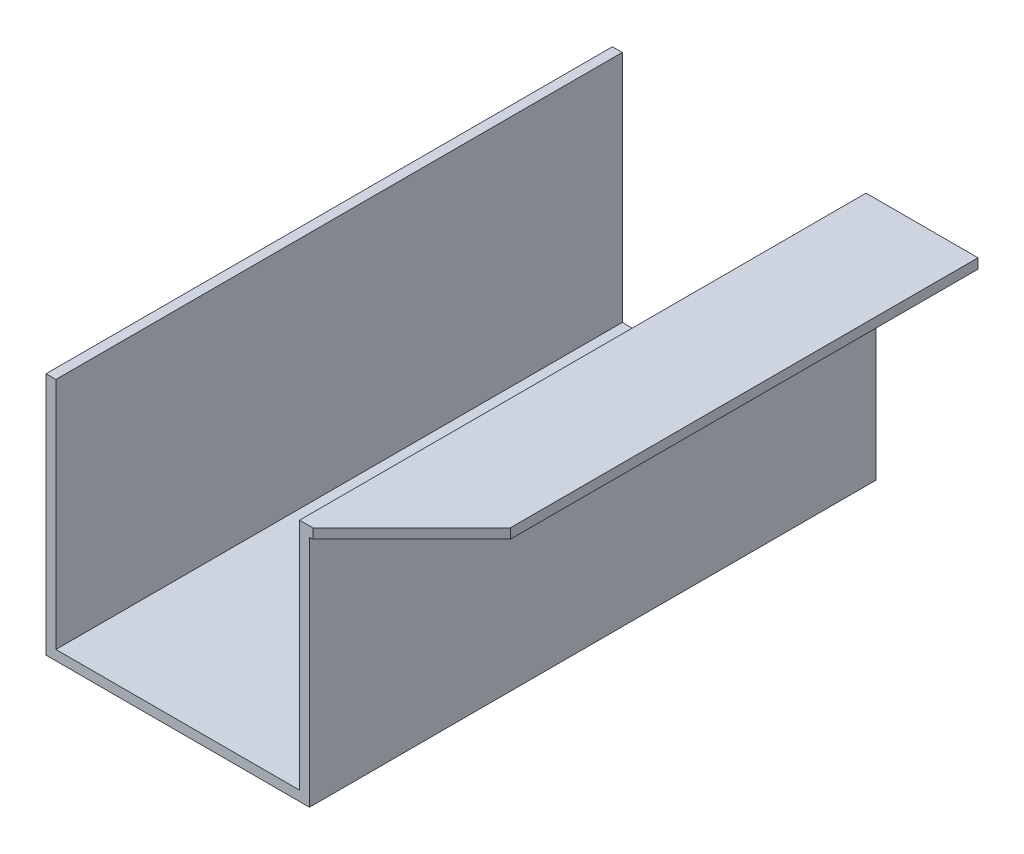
ISO-10303-21;
HEADER;
FILE_DESCRIPTION(('STEP AP214'),'2;1');
FILE_NAME('part.step','',(''),(''),'','','');
FILE_SCHEMA(('AUTOMOTIVE_DESIGN { 1 0 10303 214 1 1 1 1 }'));
ENDSEC;
DATA;
#1=APPLICATION_CONTEXT('core data for automotive mechanical design processes');
#2=APPLICATION_PROTOCOL_DEFINITION('international standard','automotive_design',2000,#1);
#3=PRODUCT_CONTEXT('',#1,'mechanical');
#4=PRODUCT('Part','Part','',(#3));
#5=PRODUCT_RELATED_PRODUCT_CATEGORY('part','',(#4));
#6=PRODUCT_DEFINITION_FORMATION('','',#4);
#7=PRODUCT_DEFINITION_CONTEXT('part definition',#1,'design');
#8=PRODUCT_DEFINITION('design','',#6,#7);
#9=PRODUCT_DEFINITION_SHAPE('','',#8);
#10=(LENGTH_UNIT() NAMED_UNIT(*) SI_UNIT(.MILLI.,.METRE.));
#11=(NAMED_UNIT(*) PLANE_ANGLE_UNIT() SI_UNIT($,.RADIAN.));
#12=(NAMED_UNIT(*) SI_UNIT($,.STERADIAN.) SOLID_ANGLE_UNIT());
#13=UNCERTAINTY_MEASURE_WITH_UNIT(LENGTH_MEASURE(1.E-05),#10,'distance_accuracy_value','');
#14=(GEOMETRIC_REPRESENTATION_CONTEXT(3) GLOBAL_UNCERTAINTY_ASSIGNED_CONTEXT((#13)) GLOBAL_UNIT_ASSIGNED_CONTEXT((#10,
#11,#12)) REPRESENTATION_CONTEXT('',''));
#15=CARTESIAN_POINT('',(0.,0.,0.));
#16=DIRECTION('',(0.,0.,1.));
#17=DIRECTION('',(1.,0.,0.));
#18=AXIS2_PLACEMENT_3D('',#15,#16,#17);
#19=CARTESIAN_POINT('',(-1.5,0.,86.));
#20=DIRECTION('',(0.,-1.,0.));
#21=DIRECTION('',(0.,0.,-1.));
#22=AXIS2_PLACEMENT_3D('',#19,#20,#21);
#23=PLANE('',#22);
#24=DIRECTION('',(-1.,0.,0.));
#25=VECTOR('',#24,1.);
#26=CARTESIAN_POINT('',(-1.5,0.,0.));
#27=LINE('',#26,#25);
#28=CARTESIAN_POINT('',(0.,0.,0.));
#29=VERTEX_POINT('',#28);
#30=CARTESIAN_POINT('',(-1.5,0.,0.));
#31=VERTEX_POINT('',#30);
#32=EDGE_CURVE('E115',#29,#31,#27,.T.);
#33=ORIENTED_EDGE('',*,*,#32,.T.);
#34=DIRECTION('',(0.,0.,-1.));
#35=VECTOR('',#34,1.);
#36=CARTESIAN_POINT('',(-1.5,0.,86.));
#37=LINE('',#36,#35);
#38=CARTESIAN_POINT('',(-1.5,0.,86.));
#39=VERTEX_POINT('',#38);
#40=EDGE_CURVE('E123',#39,#31,#37,.T.);
#41=ORIENTED_EDGE('',*,*,#40,.F.);
#42=DIRECTION('',(-1.,0.,0.));
#43=VECTOR('',#42,1.);
#44=CARTESIAN_POINT('',(-1.5,0.,86.));
#45=LINE('',#44,#43);
#46=CARTESIAN_POINT('',(0.,0.,86.));
#47=VERTEX_POINT('',#46);
#48=EDGE_CURVE('E154',#47,#39,#45,.T.);
#49=ORIENTED_EDGE('',*,*,#48,.F.);
#50=DIRECTION('',(0.,0.,-1.));
#51=VECTOR('',#50,1.);
#52=CARTESIAN_POINT('',(0.,0.,86.));
#53=LINE('',#52,#51);
#54=EDGE_CURVE('E134',#47,#29,#53,.T.);
#55=ORIENTED_EDGE('',*,*,#54,.T.);
#56=EDGE_LOOP('',(#33,#41,#49,#55));
#57=FACE_BOUND('',#56,.T.);
#58=ADVANCED_FACE('F30',(#57),#23,.F.);
#59=CARTESIAN_POINT('',(-1.5,0.,86.));
#60=DIRECTION('',(1.,0.,0.));
#61=DIRECTION('',(0.,1.,0.));
#62=AXIS2_PLACEMENT_3D('',#59,#60,#61);
#63=PLANE('',#62);
#64=DIRECTION('',(0.,-1.,0.));
#65=VECTOR('',#64,1.);
#66=CARTESIAN_POINT('',(-1.5,0.,0.));
#67=LINE('',#66,#65);
#68=CARTESIAN_POINT('',(-1.5,-37.,0.));
#69=VERTEX_POINT('',#68);
#70=EDGE_CURVE('E110',#31,#69,#67,.T.);
#71=ORIENTED_EDGE('',*,*,#70,.T.);
#72=DIRECTION('',(0.,0.,-1.));
#73=VECTOR('',#72,1.);
#74=CARTESIAN_POINT('',(-1.5,-37.,86.));
#75=LINE('',#74,#73);
#76=CARTESIAN_POINT('',(-1.5,-37.,86.));
#77=VERTEX_POINT('',#76);
#78=EDGE_CURVE('E130',#77,#69,#75,.T.);
#79=ORIENTED_EDGE('',*,*,#78,.F.);
#80=DIRECTION('',(0.,-1.,0.));
#81=VECTOR('',#80,1.);
#82=CARTESIAN_POINT('',(-1.5,0.,86.));
#83=LINE('',#82,#81);
#84=EDGE_CURVE('E125',#39,#77,#83,.T.);
#85=ORIENTED_EDGE('',*,*,#84,.F.);
#86=ORIENTED_EDGE('',*,*,#40,.T.);
#87=EDGE_LOOP('',(#71,#79,#85,#86));
#88=FACE_BOUND('',#87,.T.);
#89=ADVANCED_FACE('F124',(#88),#63,.F.);
#90=CARTESIAN_POINT('',(-1.5,-37.,86.));
#91=DIRECTION('',(0.,1.,0.));
#92=DIRECTION('',(0.,0.,1.));
#93=AXIS2_PLACEMENT_3D('',#90,#91,#92);
#94=PLANE('',#93);
#95=DIRECTION('',(1.,0.,0.));
#96=VECTOR('',#95,1.);
#97=CARTESIAN_POINT('',(-1.5,-37.,0.));
#98=LINE('',#97,#96);
#99=CARTESIAN_POINT('',(38.5,-37.,0.));
#100=VERTEX_POINT('',#99);
#101=EDGE_CURVE('E117',#69,#100,#98,.T.);
#102=ORIENTED_EDGE('',*,*,#101,.T.);
#103=DIRECTION('',(0.,0.,-1.));
#104=VECTOR('',#103,1.);
#105=CARTESIAN_POINT('',(38.5,-37.,86.));
#106=LINE('',#105,#104);
#107=CARTESIAN_POINT('',(38.5,-37.,86.));
#108=VERTEX_POINT('',#107);
#109=EDGE_CURVE('E189',#108,#100,#106,.T.);
#110=ORIENTED_EDGE('',*,*,#109,.F.);
#111=DIRECTION('',(1.,0.,0.));
#112=VECTOR('',#111,1.);
#113=CARTESIAN_POINT('',(-1.5,-37.,86.));
#114=LINE('',#113,#112);
#115=EDGE_CURVE('E157',#77,#108,#114,.T.);
#116=ORIENTED_EDGE('',*,*,#115,.F.);
#117=ORIENTED_EDGE('',*,*,#78,.T.);
#118=EDGE_LOOP('',(#102,#110,#116,#117));
#119=FACE_BOUND('',#118,.T.);
#120=ADVANCED_FACE('F220',(#119),#94,.F.);
#121=CARTESIAN_POINT('',(38.5,-37.,86.));
#122=DIRECTION('',(-1.,0.,0.));
#123=DIRECTION('',(0.,0.,1.));
#124=AXIS2_PLACEMENT_3D('',#121,#122,#123);
#125=PLANE('',#124);
#126=DIRECTION('',(0.,1.,0.));
#127=VECTOR('',#126,1.);
#128=CARTESIAN_POINT('',(38.5,-37.,0.));
#129=LINE('',#128,#127);
#130=CARTESIAN_POINT('',(38.5,-1.5,0.));
#131=VERTEX_POINT('',#130);
#132=EDGE_CURVE('E138',#100,#131,#129,.T.);
#133=ORIENTED_EDGE('',*,*,#132,.T.);
#134=DIRECTION('',(0.,0.,-1.));
#135=VECTOR('',#134,1.);
#136=CARTESIAN_POINT('',(38.5,-1.5,86.));
#137=LINE('',#136,#135);
#138=CARTESIAN_POINT('',(38.5,-1.5,86.));
#139=VERTEX_POINT('',#138);
#140=EDGE_CURVE('E186',#139,#131,#137,.T.);
#141=ORIENTED_EDGE('',*,*,#140,.F.);
#142=DIRECTION('',(0.,1.,0.));
#143=VECTOR('',#142,1.);
#144=CARTESIAN_POINT('',(38.5,-37.,86.));
#145=LINE('',#144,#143);
#146=EDGE_CURVE('E159',#108,#139,#145,.T.);
#147=ORIENTED_EDGE('',*,*,#146,.F.);
#148=ORIENTED_EDGE('',*,*,#109,.T.);
#149=EDGE_LOOP('',(#133,#141,#147,#148));
#150=FACE_BOUND('',#149,.T.);
#151=ADVANCED_FACE('F224',(#150),#125,.F.);
#152=CARTESIAN_POINT('',(38.5,-1.5,86.));
#153=DIRECTION('',(0.,1.,0.));
#154=DIRECTION('',(-1.,0.,0.));
#155=AXIS2_PLACEMENT_3D('',#152,#153,#154);
#156=PLANE('',#155);
#157=DIRECTION('',(0.,0.,-1.));
#158=VECTOR('',#157,1.);
#159=CARTESIAN_POINT('',(54.,-1.5,86.));
#160=LINE('',#159,#158);
#161=CARTESIAN_POINT('',(54.,-1.5,71.));
#162=VERTEX_POINT('',#161);
#163=CARTESIAN_POINT('',(54.,-1.5,0.));
#164=VERTEX_POINT('',#163);
#165=EDGE_CURVE('E184',#162,#164,#160,.T.);
#166=ORIENTED_EDGE('',*,*,#165,.F.);
#167=DIRECTION('',(-0.707106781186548,0.,0.707106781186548));
#168=VECTOR('',#167,1.);
#169=CARTESIAN_POINT('',(39.,-1.5,86.));
#170=LINE('',#169,#168);
#171=CARTESIAN_POINT('',(39.,-1.5,86.));
#172=VERTEX_POINT('',#171);
#173=EDGE_CURVE('E11',#162,#172,#170,.T.);
#174=ORIENTED_EDGE('',*,*,#173,.T.);
#175=DIRECTION('',(1.,0.,0.));
#176=VECTOR('',#175,1.);
#177=CARTESIAN_POINT('',(38.5,-1.5,86.));
#178=LINE('',#177,#176);
#179=EDGE_CURVE('E161',#139,#172,#178,.T.);
#180=ORIENTED_EDGE('',*,*,#179,.F.);
#181=ORIENTED_EDGE('',*,*,#140,.T.);
#182=DIRECTION('',(1.,0.,0.));
#183=VECTOR('',#182,1.);
#184=CARTESIAN_POINT('',(38.5,-1.5,0.));
#185=LINE('',#184,#183);
#186=EDGE_CURVE('E140',#131,#164,#185,.T.);
#187=ORIENTED_EDGE('',*,*,#186,.T.);
#188=EDGE_LOOP('',(#166,#174,#180,#181,#187));
#189=FACE_BOUND('',#188,.T.);
#190=ADVANCED_FACE('F227',(#189),#156,.F.);
#191=CARTESIAN_POINT('',(54.,-1.5,86.));
#192=DIRECTION('',(-1.,0.,0.));
#193=DIRECTION('',(0.,0.,1.));
#194=AXIS2_PLACEMENT_3D('',#191,#192,#193);
#195=PLANE('',#194);
#196=DIRECTION('',(0.,0.,-1.));
#197=VECTOR('',#196,1.);
#198=CARTESIAN_POINT('',(54.,0.,86.));
#199=LINE('',#198,#197);
#200=CARTESIAN_POINT('',(54.,0.,71.));
#201=VERTEX_POINT('',#200);
#202=CARTESIAN_POINT('',(54.,0.,0.));
#203=VERTEX_POINT('',#202);
#204=EDGE_CURVE('E182',#201,#203,#199,.T.);
#205=ORIENTED_EDGE('',*,*,#204,.F.);
#206=DIRECTION('',(0.,-1.,0.));
#207=VECTOR('',#206,1.);
#208=CARTESIAN_POINT('',(54.,-1.5,71.));
#209=LINE('',#208,#207);
#210=EDGE_CURVE('E37',#201,#162,#209,.T.);
#211=ORIENTED_EDGE('',*,*,#210,.T.);
#212=ORIENTED_EDGE('',*,*,#165,.T.);
#213=DIRECTION('',(0.,1.,0.));
#214=VECTOR('',#213,1.);
#215=CARTESIAN_POINT('',(54.,-1.5,0.));
#216=LINE('',#215,#214);
#217=EDGE_CURVE('E143',#164,#203,#216,.T.);
#218=ORIENTED_EDGE('',*,*,#217,.T.);
#219=EDGE_LOOP('',(#205,#211,#212,#218));
#220=FACE_BOUND('',#219,.T.);
#221=ADVANCED_FACE('F248',(#220),#195,.F.);
#222=CARTESIAN_POINT('',(37.,0.,86.));
#223=DIRECTION('',(0.,-1.,0.));
#224=DIRECTION('',(0.,0.,-1.));
#225=AXIS2_PLACEMENT_3D('',#222,#223,#224);
#226=PLANE('',#225);
#227=DIRECTION('',(-1.,0.,0.));
#228=VECTOR('',#227,1.);
#229=CARTESIAN_POINT('',(37.,0.,86.));
#230=LINE('',#229,#228);
#231=CARTESIAN_POINT('',(39.,0.,86.));
#232=VERTEX_POINT('',#231);
#233=CARTESIAN_POINT('',(37.,0.,86.));
#234=VERTEX_POINT('',#233);
#235=EDGE_CURVE('E164',#232,#234,#230,.T.);
#236=ORIENTED_EDGE('',*,*,#235,.F.);
#237=DIRECTION('',(0.707106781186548,0.,-0.707106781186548));
#238=VECTOR('',#237,1.);
#239=CARTESIAN_POINT('',(39.,0.,86.));
#240=LINE('',#239,#238);
#241=EDGE_CURVE('E51',#232,#201,#240,.T.);
#242=ORIENTED_EDGE('',*,*,#241,.T.);
#243=ORIENTED_EDGE('',*,*,#204,.T.);
#244=DIRECTION('',(-1.,0.,0.));
#245=VECTOR('',#244,1.);
#246=CARTESIAN_POINT('',(37.,0.,0.));
#247=LINE('',#246,#245);
#248=CARTESIAN_POINT('',(37.,0.,0.));
#249=VERTEX_POINT('',#248);
#250=EDGE_CURVE('E146',#203,#249,#247,.T.);
#251=ORIENTED_EDGE('',*,*,#250,.T.);
#252=DIRECTION('',(0.,0.,-1.));
#253=VECTOR('',#252,1.);
#254=CARTESIAN_POINT('',(37.,0.,86.));
#255=LINE('',#254,#253);
#256=EDGE_CURVE('E179',#234,#249,#255,.T.);
#257=ORIENTED_EDGE('',*,*,#256,.F.);
#258=EDGE_LOOP('',(#236,#242,#243,#251,#257));
#259=FACE_BOUND('',#258,.T.);
#260=ADVANCED_FACE('F202',(#259),#226,.F.);
#261=CARTESIAN_POINT('',(37.,-35.5,86.));
#262=DIRECTION('',(1.,0.,0.));
#263=DIRECTION('',(0.,0.,-1.));
#264=AXIS2_PLACEMENT_3D('',#261,#262,#263);
#265=PLANE('',#264);
#266=DIRECTION('',(0.,-1.,0.));
#267=VECTOR('',#266,1.);
#268=CARTESIAN_POINT('',(37.,-35.5,0.));
#269=LINE('',#268,#267);
#270=CARTESIAN_POINT('',(37.,-35.5,0.));
#271=VERTEX_POINT('',#270);
#272=EDGE_CURVE('E148',#249,#271,#269,.T.);
#273=ORIENTED_EDGE('',*,*,#272,.T.);
#274=DIRECTION('',(0.,0.,-1.));
#275=VECTOR('',#274,1.);
#276=CARTESIAN_POINT('',(37.,-35.5,86.));
#277=LINE('',#276,#275);
#278=CARTESIAN_POINT('',(37.,-35.5,86.));
#279=VERTEX_POINT('',#278);
#280=EDGE_CURVE('E176',#279,#271,#277,.T.);
#281=ORIENTED_EDGE('',*,*,#280,.F.);
#282=DIRECTION('',(0.,-1.,0.));
#283=VECTOR('',#282,1.);
#284=CARTESIAN_POINT('',(37.,-35.5,86.));
#285=LINE('',#284,#283);
#286=EDGE_CURVE('E166',#234,#279,#285,.T.);
#287=ORIENTED_EDGE('',*,*,#286,.F.);
#288=ORIENTED_EDGE('',*,*,#256,.T.);
#289=EDGE_LOOP('',(#273,#281,#287,#288));
#290=FACE_BOUND('',#289,.T.);
#291=ADVANCED_FACE('F208',(#290),#265,.F.);
#292=CARTESIAN_POINT('',(0.,-35.5,86.));
#293=DIRECTION('',(0.,-1.,0.));
#294=DIRECTION('',(0.,0.,-1.));
#295=AXIS2_PLACEMENT_3D('',#292,#293,#294);
#296=PLANE('',#295);
#297=DIRECTION('',(-1.,0.,0.));
#298=VECTOR('',#297,1.);
#299=CARTESIAN_POINT('',(0.,-35.5,0.));
#300=LINE('',#299,#298);
#301=CARTESIAN_POINT('',(0.,-35.5,0.));
#302=VERTEX_POINT('',#301);
#303=EDGE_CURVE('E150',#271,#302,#300,.T.);
#304=ORIENTED_EDGE('',*,*,#303,.T.);
#305=DIRECTION('',(0.,0.,-1.));
#306=VECTOR('',#305,1.);
#307=CARTESIAN_POINT('',(0.,-35.5,86.));
#308=LINE('',#307,#306);
#309=CARTESIAN_POINT('',(0.,-35.5,86.));
#310=VERTEX_POINT('',#309);
#311=EDGE_CURVE('E173',#310,#302,#308,.T.);
#312=ORIENTED_EDGE('',*,*,#311,.F.);
#313=DIRECTION('',(-1.,0.,0.));
#314=VECTOR('',#313,1.);
#315=CARTESIAN_POINT('',(0.,-35.5,86.));
#316=LINE('',#315,#314);
#317=EDGE_CURVE('E168',#279,#310,#316,.T.);
#318=ORIENTED_EDGE('',*,*,#317,.F.);
#319=ORIENTED_EDGE('',*,*,#280,.T.);
#320=EDGE_LOOP('',(#304,#312,#318,#319));
#321=FACE_BOUND('',#320,.T.);
#322=ADVANCED_FACE('F213',(#321),#296,.F.);
#323=CARTESIAN_POINT('',(0.,0.,86.));
#324=DIRECTION('',(-1.,0.,0.));
#325=DIRECTION('',(0.,-1.,0.));
#326=AXIS2_PLACEMENT_3D('',#323,#324,#325);
#327=PLANE('',#326);
#328=DIRECTION('',(0.,1.,0.));
#329=VECTOR('',#328,1.);
#330=CARTESIAN_POINT('',(0.,0.,0.));
#331=LINE('',#330,#329);
#332=EDGE_CURVE('E152',#302,#29,#331,.T.);
#333=ORIENTED_EDGE('',*,*,#332,.T.);
#334=ORIENTED_EDGE('',*,*,#54,.F.);
#335=DIRECTION('',(0.,1.,0.));
#336=VECTOR('',#335,1.);
#337=CARTESIAN_POINT('',(0.,0.,86.));
#338=LINE('',#337,#336);
#339=EDGE_CURVE('E170',#310,#47,#338,.T.);
#340=ORIENTED_EDGE('',*,*,#339,.F.);
#341=ORIENTED_EDGE('',*,*,#311,.T.);
#342=EDGE_LOOP('',(#333,#334,#340,#341));
#343=FACE_BOUND('',#342,.T.);
#344=ADVANCED_FACE('F216',(#343),#327,.F.);
#345=CARTESIAN_POINT('',(37.,0.,86.));
#346=DIRECTION('',(0.,0.,1.));
#347=DIRECTION('',(1.,0.,0.));
#348=AXIS2_PLACEMENT_3D('',#345,#346,#347);
#349=PLANE('',#348);
#350=ORIENTED_EDGE('',*,*,#179,.T.);
#351=DIRECTION('',(0.,1.,0.));
#352=VECTOR('',#351,1.);
#353=CARTESIAN_POINT('',(39.,0.,86.));
#354=LINE('',#353,#352);
#355=EDGE_CURVE('E129',#172,#232,#354,.T.);
#356=ORIENTED_EDGE('',*,*,#355,.T.);
#357=ORIENTED_EDGE('',*,*,#235,.T.);
#358=ORIENTED_EDGE('',*,*,#286,.T.);
#359=ORIENTED_EDGE('',*,*,#317,.T.);
#360=ORIENTED_EDGE('',*,*,#339,.T.);
#361=ORIENTED_EDGE('',*,*,#48,.T.);
#362=ORIENTED_EDGE('',*,*,#84,.T.);
#363=ORIENTED_EDGE('',*,*,#115,.T.);
#364=ORIENTED_EDGE('',*,*,#146,.T.);
#365=EDGE_LOOP('',(#350,#356,#357,#358,#359,#360,#361,#362,#363,#364));
#366=FACE_BOUND('',#365,.T.);
#367=ADVANCED_FACE('F197',(#366),#349,.T.);
#368=CARTESIAN_POINT('',(37.,0.,0.));
#369=DIRECTION('',(0.,0.,1.));
#370=DIRECTION('',(1.,0.,0.));
#371=AXIS2_PLACEMENT_3D('',#368,#369,#370);
#372=PLANE('',#371);
#373=ORIENTED_EDGE('',*,*,#32,.F.);
#374=ORIENTED_EDGE('',*,*,#332,.F.);
#375=ORIENTED_EDGE('',*,*,#303,.F.);
#376=ORIENTED_EDGE('',*,*,#272,.F.);
#377=ORIENTED_EDGE('',*,*,#250,.F.);
#378=ORIENTED_EDGE('',*,*,#217,.F.);
#379=ORIENTED_EDGE('',*,*,#186,.F.);
#380=ORIENTED_EDGE('',*,*,#132,.F.);
#381=ORIENTED_EDGE('',*,*,#101,.F.);
#382=ORIENTED_EDGE('',*,*,#70,.F.);
#383=EDGE_LOOP('',(#373,#374,#375,#376,#377,#378,#379,#380,#381,#382));
#384=FACE_BOUND('',#383,.T.);
#385=ADVANCED_FACE('F112',(#384),#372,.F.);
#386=CARTESIAN_POINT('',(39.,0.,86.));
#387=DIRECTION('',(0.707106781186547,0.,0.707106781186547));
#388=DIRECTION('',(0.707106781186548,0.,-0.707106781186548));
#389=AXIS2_PLACEMENT_3D('',#386,#387,#388);
#390=PLANE('',#389);
#391=ORIENTED_EDGE('',*,*,#173,.F.);
#392=ORIENTED_EDGE('',*,*,#210,.F.);
#393=ORIENTED_EDGE('',*,*,#241,.F.);
#394=ORIENTED_EDGE('',*,*,#355,.F.);
#395=EDGE_LOOP('',(#391,#392,#393,#394));
#396=FACE_BOUND('',#395,.T.);
#397=ADVANCED_FACE('F228',(#396),#390,.T.);
#398=CLOSED_SHELL('',(#58,#89,#120,#151,#190,#221,#260,#291,#322,#344,#367,#385,#397));
#399=MANIFOLD_SOLID_BREP('B2',#398);
#400=ADVANCED_BREP_SHAPE_REPRESENTATION('',(#18,#399),#14);
#401=SHAPE_DEFINITION_REPRESENTATION(#9,#400);
ENDSEC;
END-ISO-10303-21;
